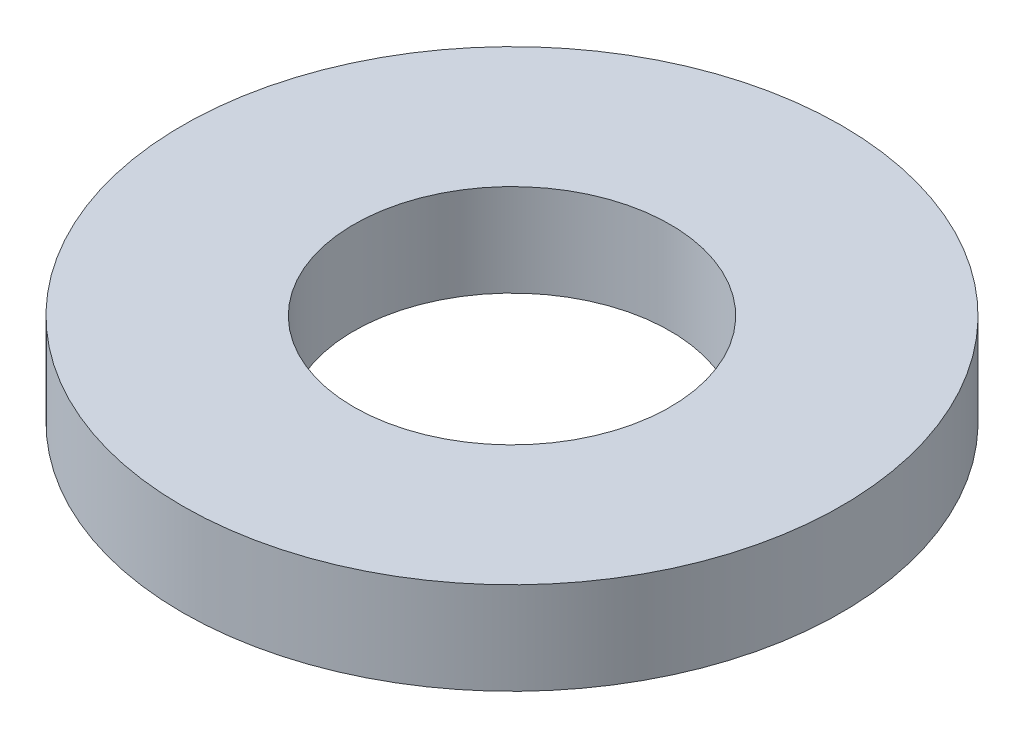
from build123d import *

# Parameters (mm, degrees)
SKETCH1_R      = 3.175
SKETCH1_R_2    = 1.524
EXTRUDE1_DEPTH = 0.889


with BuildPart() as part:
    # Sketch1 → Extrude1 (new body)
    with BuildSketch(Plane(origin=(0, 0, 0), x_dir=(1, 0, 0), z_dir=(0, 1, 0))):
        with Locations(Location((0, 0, 0), (0, 0, 270))):
            Circle(SKETCH1_R)
        with Locations(Location((0, 0, 0), (0, 0, 270))):
            Circle(SKETCH1_R_2, mode=Mode.SUBTRACT)
    extrude(amount=EXTRUDE1_DEPTH)


solid = part.part
